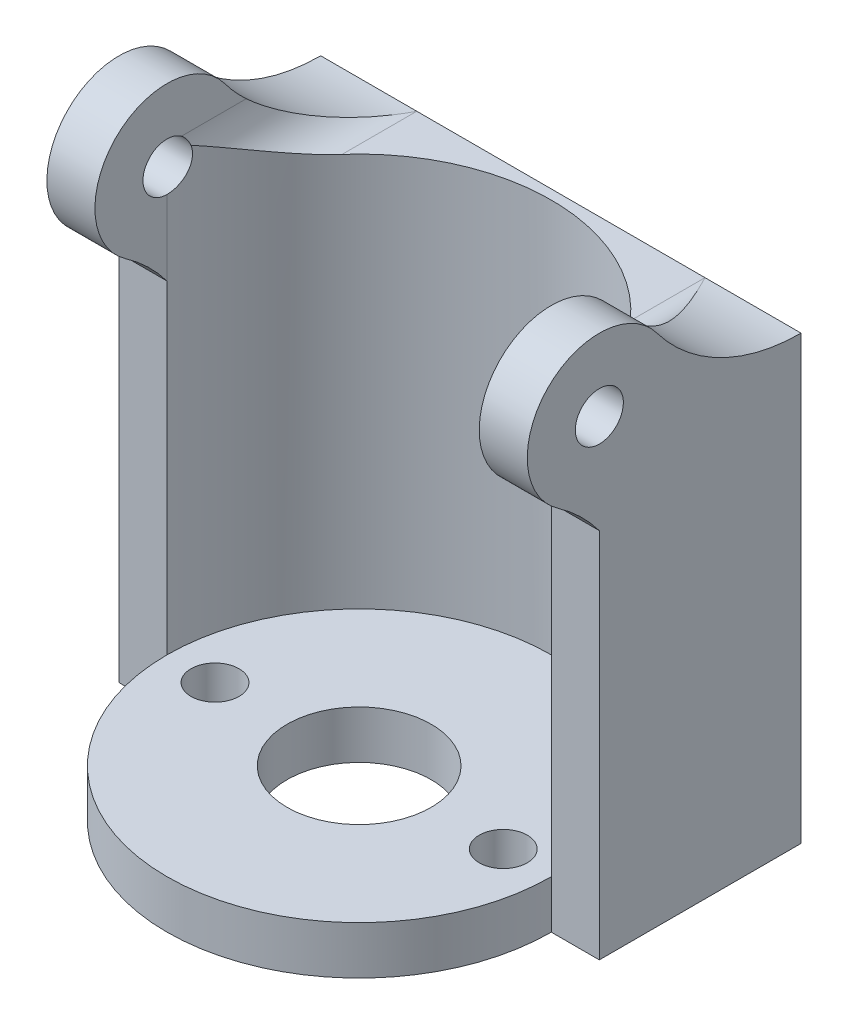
ISO-10303-21;
HEADER;
FILE_DESCRIPTION(('STEP AP214'),'2;1');
FILE_NAME('part.step','',(''),(''),'','','');
FILE_SCHEMA(('AUTOMOTIVE_DESIGN { 1 0 10303 214 1 1 1 1 }'));
ENDSEC;
DATA;
#1=APPLICATION_CONTEXT('core data for automotive mechanical design processes');
#2=APPLICATION_PROTOCOL_DEFINITION('international standard','automotive_design',2000,#1);
#3=PRODUCT_CONTEXT('',#1,'mechanical');
#4=PRODUCT('Part','Part','',(#3));
#5=PRODUCT_RELATED_PRODUCT_CATEGORY('part','',(#4));
#6=PRODUCT_DEFINITION_FORMATION('','',#4);
#7=PRODUCT_DEFINITION_CONTEXT('part definition',#1,'design');
#8=PRODUCT_DEFINITION('design','',#6,#7);
#9=PRODUCT_DEFINITION_SHAPE('','',#8);
#10=(LENGTH_UNIT() NAMED_UNIT(*) SI_UNIT(.MILLI.,.METRE.));
#11=(NAMED_UNIT(*) PLANE_ANGLE_UNIT() SI_UNIT($,.RADIAN.));
#12=(NAMED_UNIT(*) SI_UNIT($,.STERADIAN.) SOLID_ANGLE_UNIT());
#13=UNCERTAINTY_MEASURE_WITH_UNIT(LENGTH_MEASURE(1.E-05),#10,'distance_accuracy_value','');
#14=(GEOMETRIC_REPRESENTATION_CONTEXT(3) GLOBAL_UNCERTAINTY_ASSIGNED_CONTEXT((#13)) GLOBAL_UNIT_ASSIGNED_CONTEXT((#10,
#11,#12)) REPRESENTATION_CONTEXT('',''));
#15=CARTESIAN_POINT('',(0.,0.,0.));
#16=DIRECTION('',(0.,0.,1.));
#17=DIRECTION('',(1.,0.,0.));
#18=AXIS2_PLACEMENT_3D('',#15,#16,#17);
#19=CARTESIAN_POINT('',(0.,9.2,0.));
#20=DIRECTION('',(0.,1.,0.));
#21=DIRECTION('',(0.,0.,1.));
#22=AXIS2_PLACEMENT_3D('',#19,#20,#21);
#23=PLANE('',#22);
#24=DIRECTION('',(-1.,0.,0.));
#25=VECTOR('',#24,1.);
#26=CARTESIAN_POINT('',(-5.,9.2,-4.2));
#27=LINE('',#26,#25);
#28=CARTESIAN_POINT('',(3.,9.2,-4.2));
#29=VERTEX_POINT('',#28);
#30=CARTESIAN_POINT('',(-3.,9.2,-4.2));
#31=VERTEX_POINT('',#30);
#32=EDGE_CURVE('E217',#29,#31,#27,.T.);
#33=ORIENTED_EDGE('',*,*,#32,.T.);
#34=DIRECTION('',(0.,0.,-1.));
#35=VECTOR('',#34,1.);
#36=CARTESIAN_POINT('',(-3.,9.2,0.));
#37=LINE('',#36,#35);
#38=CARTESIAN_POINT('',(-3.,9.2,-2.64575131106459));
#39=VERTEX_POINT('',#38);
#40=EDGE_CURVE('E306',#31,#39,#37,.F.);
#41=ORIENTED_EDGE('',*,*,#40,.T.);
#42=CARTESIAN_POINT('',(0.,9.2,0.));
#43=DIRECTION('',(0.,-1.,0.));
#44=DIRECTION('',(0.,0.,1.));
#45=AXIS2_PLACEMENT_3D('',#42,#43,#44);
#46=CIRCLE('',#45,4.);
#47=CARTESIAN_POINT('',(3.,9.2,-2.64575131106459));
#48=VERTEX_POINT('',#47);
#49=EDGE_CURVE('E203',#39,#48,#46,.T.);
#50=ORIENTED_EDGE('',*,*,#49,.T.);
#51=DIRECTION('',(0.,0.,-1.));
#52=VECTOR('',#51,1.);
#53=CARTESIAN_POINT('',(3.,9.2,0.));
#54=LINE('',#53,#52);
#55=EDGE_CURVE('E302',#48,#29,#54,.T.);
#56=ORIENTED_EDGE('',*,*,#55,.T.);
#57=EDGE_LOOP('',(#33,#41,#50,#56));
#58=FACE_BOUND('',#57,.T.);
#59=ADVANCED_FACE('F41',(#58),#23,.T.);
#60=CARTESIAN_POINT('',(-4.,0.,0.));
#61=DIRECTION('',(0.,0.,1.));
#62=DIRECTION('',(1.,0.,0.));
#63=AXIS2_PLACEMENT_3D('',#60,#61,#62);
#64=PLANE('',#63);
#65=DIRECTION('',(0.,1.,0.));
#66=VECTOR('',#65,1.);
#67=CARTESIAN_POINT('',(-4.,0.,0.));
#68=LINE('',#67,#66);
#69=CARTESIAN_POINT('',(-4.,1.,0.));
#70=VERTEX_POINT('',#69);
#71=CARTESIAN_POINT('',(-4.,7.73938867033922,0.));
#72=VERTEX_POINT('',#71);
#73=EDGE_CURVE('E245',#70,#72,#68,.T.);
#74=ORIENTED_EDGE('',*,*,#73,.T.);
#75=DIRECTION('',(-1.,0.,0.));
#76=VECTOR('',#75,1.);
#77=CARTESIAN_POINT('',(-4.,7.73938867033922,0.));
#78=LINE('',#77,#76);
#79=CARTESIAN_POINT('',(-5.,7.73938867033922,0.));
#80=VERTEX_POINT('',#79);
#81=EDGE_CURVE('E199',#72,#80,#78,.T.);
#82=ORIENTED_EDGE('',*,*,#81,.T.);
#83=DIRECTION('',(0.,1.,0.));
#84=VECTOR('',#83,1.);
#85=CARTESIAN_POINT('',(-5.,0.,0.));
#86=LINE('',#85,#84);
#87=CARTESIAN_POINT('',(-5.,0.,0.));
#88=VERTEX_POINT('',#87);
#89=EDGE_CURVE('E246',#88,#80,#86,.T.);
#90=ORIENTED_EDGE('',*,*,#89,.F.);
#91=DIRECTION('',(1.,0.,0.));
#92=VECTOR('',#91,1.);
#93=CARTESIAN_POINT('',(-4.,0.,0.));
#94=LINE('',#93,#92);
#95=CARTESIAN_POINT('',(-4.,0.,0.));
#96=VERTEX_POINT('',#95);
#97=EDGE_CURVE('E236',#88,#96,#94,.T.);
#98=ORIENTED_EDGE('',*,*,#97,.T.);
#99=EDGE_CURVE('E240',#96,#70,#68,.T.);
#100=ORIENTED_EDGE('',*,*,#99,.T.);
#101=EDGE_LOOP('',(#74,#82,#90,#98,#100));
#102=FACE_BOUND('',#101,.T.);
#103=ADVANCED_FACE('F398',(#102),#64,.T.);
#104=CARTESIAN_POINT('',(0.,1.,0.));
#105=DIRECTION('',(0.,1.,0.));
#106=DIRECTION('',(0.,0.,1.));
#107=AXIS2_PLACEMENT_3D('',#104,#105,#106);
#108=PLANE('',#107);
#109=CARTESIAN_POINT('',(3.,1.,0.));
#110=DIRECTION('',(0.,1.,0.));
#111=DIRECTION('',(0.,0.,1.));
#112=AXIS2_PLACEMENT_3D('',#109,#110,#111);
#113=CIRCLE('',#112,0.5);
#114=CARTESIAN_POINT('',(3.,1.,0.499999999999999));
#115=VERTEX_POINT('',#114);
#116=EDGE_CURVE('E274',#115,#115,#113,.T.);
#117=ORIENTED_EDGE('',*,*,#116,.F.);
#118=EDGE_LOOP('',(#117));
#119=FACE_BOUND('',#118,.T.);
#120=CARTESIAN_POINT('',(0.,1.,0.));
#121=DIRECTION('',(0.,1.,0.));
#122=DIRECTION('',(0.,0.,1.));
#123=AXIS2_PLACEMENT_3D('',#120,#121,#122);
#124=CIRCLE('',#123,4.);
#125=CARTESIAN_POINT('',(4.,1.,0.));
#126=VERTEX_POINT('',#125);
#127=EDGE_CURVE('E290',#126,#70,#124,.T.);
#128=ORIENTED_EDGE('',*,*,#127,.T.);
#129=EDGE_CURVE('E295',#70,#126,#124,.T.);
#130=ORIENTED_EDGE('',*,*,#129,.T.);
#131=EDGE_LOOP('',(#128,#130));
#132=FACE_BOUND('',#131,.T.);
#133=CARTESIAN_POINT('',(-3.,1.,0.));
#134=DIRECTION('',(0.,1.,0.));
#135=DIRECTION('',(0.,0.,1.));
#136=AXIS2_PLACEMENT_3D('',#133,#134,#135);
#137=CIRCLE('',#136,0.5);
#138=CARTESIAN_POINT('',(-3.,1.,0.5));
#139=VERTEX_POINT('',#138);
#140=EDGE_CURVE('E282',#139,#139,#137,.T.);
#141=ORIENTED_EDGE('',*,*,#140,.F.);
#142=EDGE_LOOP('',(#141));
#143=FACE_BOUND('',#142,.T.);
#144=CARTESIAN_POINT('',(0.,1.,0.));
#145=DIRECTION('',(0.,1.,0.));
#146=DIRECTION('',(0.,0.,1.));
#147=AXIS2_PLACEMENT_3D('',#144,#145,#146);
#148=CIRCLE('',#147,1.5);
#149=CARTESIAN_POINT('',(0.,1.,1.5));
#150=VERTEX_POINT('',#149);
#151=EDGE_CURVE('E266',#150,#150,#148,.T.);
#152=ORIENTED_EDGE('',*,*,#151,.F.);
#153=EDGE_LOOP('',(#152));
#154=FACE_BOUND('',#153,.T.);
#155=ADVANCED_FACE('F405',(#119,#132,#143,#154),#108,.T.);
#156=CARTESIAN_POINT('',(0.,0.,0.));
#157=DIRECTION('',(0.,1.,0.));
#158=DIRECTION('',(0.,0.,1.));
#159=AXIS2_PLACEMENT_3D('',#156,#157,#158);
#160=PLANE('',#159);
#161=CARTESIAN_POINT('',(0.,0.,0.));
#162=DIRECTION('',(0.,1.,0.));
#163=DIRECTION('',(0.,0.,1.));
#164=AXIS2_PLACEMENT_3D('',#161,#162,#163);
#165=CIRCLE('',#164,4.);
#166=CARTESIAN_POINT('',(4.,0.,0.));
#167=VERTEX_POINT('',#166);
#168=EDGE_CURVE('E286',#96,#167,#165,.T.);
#169=ORIENTED_EDGE('',*,*,#168,.F.);
#170=ORIENTED_EDGE('',*,*,#97,.F.);
#171=DIRECTION('',(0.,0.,1.));
#172=VECTOR('',#171,1.);
#173=CARTESIAN_POINT('',(-5.,0.,0.));
#174=LINE('',#173,#172);
#175=CARTESIAN_POINT('',(-5.,0.,-4.2));
#176=VERTEX_POINT('',#175);
#177=EDGE_CURVE('E232',#176,#88,#174,.T.);
#178=ORIENTED_EDGE('',*,*,#177,.F.);
#179=DIRECTION('',(-1.,0.,0.));
#180=VECTOR('',#179,1.);
#181=CARTESIAN_POINT('',(-5.,0.,-4.2));
#182=LINE('',#181,#180);
#183=CARTESIAN_POINT('',(5.,0.,-4.2));
#184=VERTEX_POINT('',#183);
#185=EDGE_CURVE('E228',#184,#176,#182,.T.);
#186=ORIENTED_EDGE('',*,*,#185,.F.);
#187=DIRECTION('',(0.,0.,-1.));
#188=VECTOR('',#187,1.);
#189=CARTESIAN_POINT('',(5.,0.,-4.2));
#190=LINE('',#189,#188);
#191=CARTESIAN_POINT('',(5.,0.,0.));
#192=VERTEX_POINT('',#191);
#193=EDGE_CURVE('E224',#192,#184,#190,.T.);
#194=ORIENTED_EDGE('',*,*,#193,.F.);
#195=DIRECTION('',(1.,0.,0.));
#196=VECTOR('',#195,1.);
#197=CARTESIAN_POINT('',(5.,0.,0.));
#198=LINE('',#197,#196);
#199=EDGE_CURVE('E220',#167,#192,#198,.T.);
#200=ORIENTED_EDGE('',*,*,#199,.F.);
#201=EDGE_LOOP('',(#169,#170,#178,#186,#194,#200));
#202=FACE_BOUND('',#201,.T.);
#203=CARTESIAN_POINT('',(-3.,0.,0.));
#204=DIRECTION('',(0.,1.,0.));
#205=DIRECTION('',(0.,0.,1.));
#206=AXIS2_PLACEMENT_3D('',#203,#204,#205);
#207=CIRCLE('',#206,0.5);
#208=CARTESIAN_POINT('',(-3.,0.,0.5));
#209=VERTEX_POINT('',#208);
#210=EDGE_CURVE('E278',#209,#209,#207,.T.);
#211=ORIENTED_EDGE('',*,*,#210,.T.);
#212=EDGE_LOOP('',(#211));
#213=FACE_BOUND('',#212,.T.);
#214=CARTESIAN_POINT('',(3.,0.,0.));
#215=DIRECTION('',(0.,1.,0.));
#216=DIRECTION('',(0.,0.,1.));
#217=AXIS2_PLACEMENT_3D('',#214,#215,#216);
#218=CIRCLE('',#217,0.5);
#219=CARTESIAN_POINT('',(3.,0.,0.499999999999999));
#220=VERTEX_POINT('',#219);
#221=EDGE_CURVE('E270',#220,#220,#218,.T.);
#222=ORIENTED_EDGE('',*,*,#221,.T.);
#223=EDGE_LOOP('',(#222));
#224=FACE_BOUND('',#223,.T.);
#225=CARTESIAN_POINT('',(0.,0.,0.));
#226=DIRECTION('',(0.,1.,0.));
#227=DIRECTION('',(0.,0.,1.));
#228=AXIS2_PLACEMENT_3D('',#225,#226,#227);
#229=CIRCLE('',#228,1.5);
#230=CARTESIAN_POINT('',(0.,0.,1.5));
#231=VERTEX_POINT('',#230);
#232=EDGE_CURVE('E244',#231,#231,#229,.T.);
#233=ORIENTED_EDGE('',*,*,#232,.T.);
#234=EDGE_LOOP('',(#233));
#235=FACE_BOUND('',#234,.T.);
#236=ADVANCED_FACE('F542',(#202,#213,#224,#235),#160,.F.);
#237=CARTESIAN_POINT('',(0.,1.,0.));
#238=DIRECTION('',(0.,-1.,0.));
#239=DIRECTION('',(0.,0.,-1.));
#240=AXIS2_PLACEMENT_3D('',#237,#238,#239);
#241=CYLINDRICAL_SURFACE('',#240,4.);
#242=ORIENTED_EDGE('',*,*,#129,.F.);
#243=ORIENTED_EDGE('',*,*,#99,.F.);
#244=ORIENTED_EDGE('',*,*,#168,.T.);
#245=DIRECTION('',(0.,1.,0.));
#246=VECTOR('',#245,1.);
#247=CARTESIAN_POINT('',(4.,0.,0.));
#248=LINE('',#247,#246);
#249=EDGE_CURVE('E262',#167,#126,#248,.T.);
#250=ORIENTED_EDGE('',*,*,#249,.T.);
#251=EDGE_LOOP('',(#242,#243,#244,#250));
#252=FACE_BOUND('',#251,.T.);
#253=ADVANCED_FACE('F539',(#252),#241,.T.);
#254=CARTESIAN_POINT('',(-3.,1.,0.));
#255=DIRECTION('',(0.,-1.,0.));
#256=DIRECTION('',(0.,0.,-1.));
#257=AXIS2_PLACEMENT_3D('',#254,#255,#256);
#258=CYLINDRICAL_SURFACE('',#257,0.5);
#259=ORIENTED_EDGE('',*,*,#140,.T.);
#260=EDGE_LOOP('',(#259));
#261=FACE_BOUND('',#260,.T.);
#262=ORIENTED_EDGE('',*,*,#210,.F.);
#263=EDGE_LOOP('',(#262));
#264=FACE_BOUND('',#263,.T.);
#265=ADVANCED_FACE('F667',(#261,#264),#258,.F.);
#266=CARTESIAN_POINT('',(3.,1.,0.));
#267=DIRECTION('',(0.,-1.,0.));
#268=DIRECTION('',(0.,0.,-1.));
#269=AXIS2_PLACEMENT_3D('',#266,#267,#268);
#270=CYLINDRICAL_SURFACE('',#269,0.5);
#271=ORIENTED_EDGE('',*,*,#116,.T.);
#272=EDGE_LOOP('',(#271));
#273=FACE_BOUND('',#272,.T.);
#274=ORIENTED_EDGE('',*,*,#221,.F.);
#275=EDGE_LOOP('',(#274));
#276=FACE_BOUND('',#275,.T.);
#277=ADVANCED_FACE('F688',(#273,#276),#270,.F.);
#278=CARTESIAN_POINT('',(0.,1.,0.));
#279=DIRECTION('',(0.,-1.,0.));
#280=DIRECTION('',(0.,0.,-1.));
#281=AXIS2_PLACEMENT_3D('',#278,#279,#280);
#282=CYLINDRICAL_SURFACE('',#281,1.5);
#283=ORIENTED_EDGE('',*,*,#151,.T.);
#284=EDGE_LOOP('',(#283));
#285=FACE_BOUND('',#284,.T.);
#286=ORIENTED_EDGE('',*,*,#232,.F.);
#287=EDGE_LOOP('',(#286));
#288=FACE_BOUND('',#287,.T.);
#289=ADVANCED_FACE('F358',(#285,#288),#282,.F.);
#290=CARTESIAN_POINT('',(0.,0.,0.));
#291=DIRECTION('',(0.,1.,0.));
#292=DIRECTION('',(0.,0.,1.));
#293=AXIS2_PLACEMENT_3D('',#290,#291,#292);
#294=CYLINDRICAL_SURFACE('',#293,4.);
#295=ORIENTED_EDGE('',*,*,#73,.F.);
#296=ORIENTED_EDGE('',*,*,#127,.F.);
#297=CARTESIAN_POINT('',(4.,7.73938867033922,0.));
#298=VERTEX_POINT('',#297);
#299=EDGE_CURVE('E116',#126,#298,#248,.T.);
#300=ORIENTED_EDGE('',*,*,#299,.T.);
#301=DIRECTION('',(0.,1.,0.));
#302=VECTOR('',#301,1.);
#303=CARTESIAN_POINT('',(4.,0.,0.));
#304=LINE('',#303,#302);
#305=CARTESIAN_POINT('',(4.,9.3,0.));
#306=VERTEX_POINT('',#305);
#307=EDGE_CURVE('E110',#298,#306,#304,.T.);
#308=ORIENTED_EDGE('',*,*,#307,.T.);
#309=CARTESIAN_POINT('',(3.97206801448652,9.96530067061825,-0.471885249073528));
#310=CARTESIAN_POINT('',(3.97096019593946,9.9389579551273,-0.481139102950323));
#311=CARTESIAN_POINT('',(3.97010345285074,9.91182189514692,-0.488142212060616));
#312=CARTESIAN_POINT('',(3.96894084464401,9.85677347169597,-0.497543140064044));
#313=CARTESIAN_POINT('',(3.96863454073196,9.82886174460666,-0.499944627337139));
#314=CARTESIAN_POINT('',(3.96861961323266,9.77301230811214,-0.500053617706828));
#315=CARTESIAN_POINT('',(3.96891132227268,9.74507459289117,-0.497758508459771));
#316=CARTESIAN_POINT('',(3.9700560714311,9.68999130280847,-0.488546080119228));
#317=CARTESIAN_POINT('',(3.97090899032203,9.66284555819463,-0.481629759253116));
#318=CARTESIAN_POINT('',(3.97308013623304,9.61010208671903,-0.46337646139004));
#319=CARTESIAN_POINT('',(3.97439839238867,9.58450445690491,-0.45203920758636));
#320=CARTESIAN_POINT('',(3.97735199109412,9.5355641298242,-0.425266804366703));
#321=CARTESIAN_POINT('',(3.97898740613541,9.5122219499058,-0.409830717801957));
#322=CARTESIAN_POINT('',(3.98240454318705,9.468292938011,-0.375177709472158));
#323=CARTESIAN_POINT('',(3.98418717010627,9.44772556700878,-0.355936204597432));
#324=CARTESIAN_POINT('',(3.98768944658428,9.41010410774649,-0.314275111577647));
#325=CARTESIAN_POINT('',(3.98940909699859,9.39304997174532,-0.291855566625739));
#326=CARTESIAN_POINT('',(3.99259910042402,9.36287960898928,-0.244376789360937));
#327=CARTESIAN_POINT('',(3.99406851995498,9.34977799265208,-0.219308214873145));
#328=CARTESIAN_POINT('',(3.99658401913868,9.32798125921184,-0.167307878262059));
#329=CARTESIAN_POINT('',(3.997630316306,9.31928387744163,-0.140377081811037));
#330=CARTESIAN_POINT('',(3.99892857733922,9.30862645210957,-0.0944113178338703));
#331=CARTESIAN_POINT('',(3.99932831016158,9.30539423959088,-0.0756654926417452));
#332=CARTESIAN_POINT('',(3.99986488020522,9.30108087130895,-0.0379491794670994));
#333=CARTESIAN_POINT('',(4.00000205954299,9.29999691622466,-0.0189790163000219));
#334=CARTESIAN_POINT('',(4.,9.3,0.));
#335=B_SPLINE_CURVE_WITH_KNOTS('',3,(#309,#310,#311,#312,#313,#314,#315,#316,#317,#318,#319,
#320,#321,#322,#323,#324,#325,#326,#327,#328,#329,#330,#331,#332,#333,#334),.UNSPECIFIED.,.F.,
.F.,(4,2,2,2,2,2,2,2,2,2,2,2,4),(0.,0.0837199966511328,0.167373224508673,0.251072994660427,
0.33475469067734,0.418441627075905,0.502147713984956,0.586413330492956,0.670677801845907,
0.755250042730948,0.839778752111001,0.896741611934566,0.953630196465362),.UNSPECIFIED.);
#336=CARTESIAN_POINT('',(3.97206801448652,9.96530067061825,-0.471885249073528));
#337=VERTEX_POINT('',#336);
#338=EDGE_CURVE('E11',#306,#337,#335,.F.);
#339=ORIENTED_EDGE('',*,*,#338,.T.);
#340=CARTESIAN_POINT('',(3.,9.2,-2.64575131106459));
#341=CARTESIAN_POINT('',(3.04308129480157,9.20002225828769,-2.5969164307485));
#342=CARTESIAN_POINT('',(3.08491225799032,9.20278131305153,-2.54706628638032));
#343=CARTESIAN_POINT('',(3.16580783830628,9.21299606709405,-2.44577843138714));
#344=CARTESIAN_POINT('',(3.20487760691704,9.22044274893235,-2.39434394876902));
#345=CARTESIAN_POINT('',(3.27984708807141,9.23918561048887,-2.29056221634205));
#346=CARTESIAN_POINT('',(3.31576990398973,9.25045013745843,-2.2382257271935));
#347=CARTESIAN_POINT('',(3.38476417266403,9.27625009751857,-2.13245420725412));
#348=CARTESIAN_POINT('',(3.41783373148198,9.29078768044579,-2.0790184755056));
#349=CARTESIAN_POINT('',(3.4986969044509,9.33147169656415,-1.94128133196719));
#350=CARTESIAN_POINT('',(3.54444475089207,9.3595766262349,-1.85634962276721));
#351=CARTESIAN_POINT('',(3.62906229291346,9.4208922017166,-1.68494910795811));
#352=CARTESIAN_POINT('',(3.66792956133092,9.45410464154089,-1.59847977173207));
#353=CARTESIAN_POINT('',(3.77483346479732,9.55989549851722,-1.33652816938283));
#354=CARTESIAN_POINT('',(3.83275455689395,9.63839391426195,-1.159225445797));
#355=CARTESIAN_POINT('',(3.91850936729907,9.79560237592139,-0.820227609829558));
#356=CARTESIAN_POINT('',(3.94876568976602,9.87351220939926,-0.658737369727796));
#357=CARTESIAN_POINT('',(3.98924683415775,10.0324153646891,-0.335223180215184));
#358=CARTESIAN_POINT('',(3.99952627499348,10.1133996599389,-0.173201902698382));
#359=CARTESIAN_POINT('',(3.99999466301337,10.1962288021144,-0.00754240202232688));
#360=CARTESIAN_POINT('',(3.99999999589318,10.1981144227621,-0.0037711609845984));
#361=CARTESIAN_POINT('',(4.,10.2,0.));
#362=B_SPLINE_CURVE_WITH_KNOTS('',3,(#340,#341,#342,#343,#344,#345,#346,#347,#348,#349,#350,
#351,#352,#353,#354,#355,#356,#357,#358,#359,#360,#361),.UNSPECIFIED.,.F.,.F.,(4,2,2,2,2,2,2,2,
2,2,4),(0.,0.195194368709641,0.390014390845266,0.583257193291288,0.776627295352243,
1.07759313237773,1.37866492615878,1.98338003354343,2.52784959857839,3.07082842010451,
3.08347754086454),.UNSPECIFIED.);
#363=EDGE_CURVE('E95',#337,#48,#362,.F.);
#364=ORIENTED_EDGE('',*,*,#363,.T.);
#365=ORIENTED_EDGE('',*,*,#49,.F.);
#366=CARTESIAN_POINT('',(-3.,9.2,-2.64575131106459));
#367=CARTESIAN_POINT('',(-3.04308129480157,9.20002225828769,-2.5969164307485));
#368=CARTESIAN_POINT('',(-3.08491225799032,9.20278131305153,-2.54706628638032));
#369=CARTESIAN_POINT('',(-3.16580783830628,9.21299606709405,-2.44577843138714));
#370=CARTESIAN_POINT('',(-3.20487760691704,9.22044274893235,-2.39434394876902));
#371=CARTESIAN_POINT('',(-3.27984708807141,9.23918561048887,-2.29056221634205));
#372=CARTESIAN_POINT('',(-3.31576990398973,9.25045013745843,-2.2382257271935));
#373=CARTESIAN_POINT('',(-3.38476417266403,9.27625009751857,-2.13245420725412));
#374=CARTESIAN_POINT('',(-3.41783373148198,9.29078768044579,-2.0790184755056));
#375=CARTESIAN_POINT('',(-3.4986969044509,9.33147169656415,-1.94128133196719));
#376=CARTESIAN_POINT('',(-3.54444475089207,9.3595766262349,-1.85634962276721));
#377=CARTESIAN_POINT('',(-3.62906229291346,9.4208922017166,-1.68494910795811));
#378=CARTESIAN_POINT('',(-3.66792956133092,9.45410464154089,-1.59847977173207));
#379=CARTESIAN_POINT('',(-3.77483346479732,9.55989549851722,-1.33652816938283));
#380=CARTESIAN_POINT('',(-3.83275455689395,9.63839391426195,-1.159225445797));
#381=CARTESIAN_POINT('',(-3.91850936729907,9.79560237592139,-0.820227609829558));
#382=CARTESIAN_POINT('',(-3.94876568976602,9.87351220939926,-0.658737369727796));
#383=CARTESIAN_POINT('',(-3.98924683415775,10.0324153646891,-0.335223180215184));
#384=CARTESIAN_POINT('',(-3.99952627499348,10.1133996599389,-0.173201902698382));
#385=CARTESIAN_POINT('',(-3.99999466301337,10.1962288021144,-0.00754240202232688));
#386=CARTESIAN_POINT('',(-3.99999999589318,10.1981144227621,-0.0037711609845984));
#387=CARTESIAN_POINT('',(-4.,10.2,0.));
#388=B_SPLINE_CURVE_WITH_KNOTS('',3,(#366,#367,#368,#369,#370,#371,#372,#373,#374,#375,#376,
#377,#378,#379,#380,#381,#382,#383,#384,#385,#386,#387),.UNSPECIFIED.,.F.,.F.,(4,2,2,2,2,2,2,2,
2,2,4),(0.,0.195194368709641,0.390014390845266,0.583257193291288,0.776627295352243,
1.07759313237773,1.37866492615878,1.98338003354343,2.52784959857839,3.07082842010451,
3.08347754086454),.UNSPECIFIED.);
#389=CARTESIAN_POINT('',(-3.97206801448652,9.96530067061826,-0.471885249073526));
#390=VERTEX_POINT('',#389);
#391=EDGE_CURVE('E72',#39,#390,#388,.T.);
#392=ORIENTED_EDGE('',*,*,#391,.T.);
#393=CARTESIAN_POINT('',(-4.,9.3,0.));
#394=CARTESIAN_POINT('',(-4.00001123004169,9.29997559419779,-0.0280129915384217));
#395=CARTESIAN_POINT('',(-3.99970605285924,9.30235266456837,-0.0560164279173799));
#396=CARTESIAN_POINT('',(-3.9985461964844,9.31172695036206,-0.111199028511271));
#397=CARTESIAN_POINT('',(-3.99769208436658,9.31871939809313,-0.13837901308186));
#398=CARTESIAN_POINT('',(-3.99551699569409,9.33714533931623,-0.191179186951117));
#399=CARTESIAN_POINT('',(-3.99419586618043,9.34858028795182,-0.216798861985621));
#400=CARTESIAN_POINT('',(-3.99123730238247,9.3755527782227,-0.265753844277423));
#401=CARTESIAN_POINT('',(-3.98959989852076,9.3910899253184,-0.289089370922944));
#402=CARTESIAN_POINT('',(-3.98618081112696,9.42591714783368,-0.33294125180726));
#403=CARTESIAN_POINT('',(-3.98439847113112,9.44522492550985,-0.353443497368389));
#404=CARTESIAN_POINT('',(-3.98089565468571,9.48700976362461,-0.390928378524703));
#405=CARTESIAN_POINT('',(-3.97917518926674,9.50948738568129,-0.407910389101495));
#406=CARTESIAN_POINT('',(-3.97598457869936,9.55706445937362,-0.437922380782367));
#407=CARTESIAN_POINT('',(-3.97451528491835,9.58217238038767,-0.45093903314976));
#408=CARTESIAN_POINT('',(-3.97200221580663,9.6342387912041,-0.472564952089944));
#409=CARTESIAN_POINT('',(-3.97095840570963,9.66119712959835,-0.481174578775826));
#410=CARTESIAN_POINT('',(-3.96942049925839,9.71605374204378,-0.493701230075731));
#411=CARTESIAN_POINT('',(-3.96892367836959,9.74394663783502,-0.497641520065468));
#412=CARTESIAN_POINT('',(-3.96852818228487,9.79999960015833,-0.500786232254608));
#413=CARTESIAN_POINT('',(-3.9686292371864,9.82815954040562,-0.499992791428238));
#414=CARTESIAN_POINT('',(-3.96928530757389,9.87465876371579,-0.49475054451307));
#415=CARTESIAN_POINT('',(-3.96967862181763,9.89315719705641,-0.49160155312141));
#416=CARTESIAN_POINT('',(-3.97070197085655,9.92965197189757,-0.483260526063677));
#417=CARTESIAN_POINT('',(-3.97133165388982,9.9476490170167,-0.47807152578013));
#418=CARTESIAN_POINT('',(-3.97206801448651,9.96530067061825,-0.471885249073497));
#419=B_SPLINE_CURVE_WITH_KNOTS('',3,(#393,#394,#395,#396,#397,#398,#399,#400,#401,#402,#403,
#404,#405,#406,#407,#408,#409,#410,#411,#412,#413,#414,#415,#416,#417,#418),.UNSPECIFIED.,.F.,
.F.,(4,2,2,2,2,2,2,2,2,2,2,2,4),(0.,0.0839225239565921,0.167758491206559,0.25162194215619,
0.33547733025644,0.419736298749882,0.504010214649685,0.588564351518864,0.673111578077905,
0.757235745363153,0.841321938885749,0.89751610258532,0.953626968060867),.UNSPECIFIED.);
#420=CARTESIAN_POINT('',(-4.,9.3,0.));
#421=VERTEX_POINT('',#420);
#422=EDGE_CURVE('E57',#421,#390,#419,.T.);
#423=ORIENTED_EDGE('',*,*,#422,.F.);
#424=DIRECTION('',(0.,1.,0.));
#425=VECTOR('',#424,1.);
#426=CARTESIAN_POINT('',(-4.,0.,0.));
#427=LINE('',#426,#425);
#428=EDGE_CURVE('E176',#72,#421,#427,.T.);
#429=ORIENTED_EDGE('',*,*,#428,.F.);
#430=EDGE_LOOP('',(#295,#296,#300,#308,#339,#364,#365,#392,#423,#429));
#431=FACE_BOUND('',#430,.T.);
#432=ADVANCED_FACE('F112',(#431),#294,.F.);
#433=CARTESIAN_POINT('',(-5.,0.,0.));
#434=DIRECTION('',(-1.,0.,0.));
#435=DIRECTION('',(0.,0.,1.));
#436=AXIS2_PLACEMENT_3D('',#433,#434,#435);
#437=PLANE('',#436);
#438=ORIENTED_EDGE('',*,*,#89,.T.);
#439=CARTESIAN_POINT('',(-5.,5.49396741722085,3.00342860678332));
#440=DIRECTION('',(-1.,0.,0.));
#441=DIRECTION('',(0.,0.,1.));
#442=AXIS2_PLACEMENT_3D('',#439,#440,#441);
#443=CIRCLE('',#442,3.75);
#444=CARTESIAN_POINT('',(-5.,8.56970497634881,0.858122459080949));
#445=VERTEX_POINT('',#444);
#446=EDGE_CURVE('E159',#445,#80,#443,.T.);
#447=ORIENTED_EDGE('',*,*,#446,.F.);
#448=CARTESIAN_POINT('',(-5.,9.8,0.));
#449=DIRECTION('',(-1.,0.,0.));
#450=DIRECTION('',(0.,0.,1.));
#451=AXIS2_PLACEMENT_3D('',#448,#449,#450);
#452=CIRCLE('',#451,1.5);
#453=CARTESIAN_POINT('',(-5.,10.7,-1.2));
#454=VERTEX_POINT('',#453);
#455=EDGE_CURVE('E188',#445,#454,#452,.T.);
#456=ORIENTED_EDGE('',*,*,#455,.T.);
#457=CARTESIAN_POINT('',(-5.,12.95,-4.2));
#458=DIRECTION('',(-1.,0.,0.));
#459=DIRECTION('',(0.,0.,1.));
#460=AXIS2_PLACEMENT_3D('',#457,#458,#459);
#461=CIRCLE('',#460,3.75);
#462=CARTESIAN_POINT('',(-5.,9.2,-4.2));
#463=VERTEX_POINT('',#462);
#464=EDGE_CURVE('E192',#454,#463,#461,.F.);
#465=ORIENTED_EDGE('',*,*,#464,.T.);
#466=DIRECTION('',(0.,1.,0.));
#467=VECTOR('',#466,1.);
#468=CARTESIAN_POINT('',(-5.,0.,-4.2));
#469=LINE('',#468,#467);
#470=EDGE_CURVE('E250',#176,#463,#469,.T.);
#471=ORIENTED_EDGE('',*,*,#470,.F.);
#472=ORIENTED_EDGE('',*,*,#177,.T.);
#473=EDGE_LOOP('',(#438,#447,#456,#465,#471,#472));
#474=FACE_BOUND('',#473,.T.);
#475=CARTESIAN_POINT('',(-5.,9.8,0.));
#476=DIRECTION('',(-1.,0.,0.));
#477=DIRECTION('',(0.,0.,1.));
#478=AXIS2_PLACEMENT_3D('',#475,#476,#477);
#479=CIRCLE('',#478,0.5);
#480=CARTESIAN_POINT('',(-5.,9.8,0.5));
#481=VERTEX_POINT('',#480);
#482=EDGE_CURVE('E168',#481,#481,#479,.T.);
#483=ORIENTED_EDGE('',*,*,#482,.F.);
#484=EDGE_LOOP('',(#483));
#485=FACE_BOUND('',#484,.T.);
#486=ADVANCED_FACE('F357',(#474,#485),#437,.T.);
#487=CARTESIAN_POINT('',(-5.,0.,-4.2));
#488=DIRECTION('',(0.,0.,-1.));
#489=DIRECTION('',(-1.,0.,0.));
#490=AXIS2_PLACEMENT_3D('',#487,#488,#489);
#491=PLANE('',#490);
#492=ORIENTED_EDGE('',*,*,#470,.T.);
#493=DIRECTION('',(-1.,0.,0.));
#494=VECTOR('',#493,1.);
#495=CARTESIAN_POINT('',(-4.,9.2,-4.2));
#496=LINE('',#495,#494);
#497=EDGE_CURVE('E204',#31,#463,#496,.T.);
#498=ORIENTED_EDGE('',*,*,#497,.F.);
#499=ORIENTED_EDGE('',*,*,#32,.F.);
#500=CARTESIAN_POINT('',(5.,9.2,-4.2));
#501=VERTEX_POINT('',#500);
#502=EDGE_CURVE('E87',#501,#29,#27,.T.);
#503=ORIENTED_EDGE('',*,*,#502,.F.);
#504=DIRECTION('',(0.,1.,0.));
#505=VECTOR('',#504,1.);
#506=CARTESIAN_POINT('',(5.,0.,-4.2));
#507=LINE('',#506,#505);
#508=EDGE_CURVE('E254',#184,#501,#507,.T.);
#509=ORIENTED_EDGE('',*,*,#508,.F.);
#510=ORIENTED_EDGE('',*,*,#185,.T.);
#511=EDGE_LOOP('',(#492,#498,#499,#503,#509,#510));
#512=FACE_BOUND('',#511,.T.);
#513=ADVANCED_FACE('F414',(#512),#491,.T.);
#514=CARTESIAN_POINT('',(5.,0.,-4.2));
#515=DIRECTION('',(1.,0.,0.));
#516=DIRECTION('',(0.,0.,-1.));
#517=AXIS2_PLACEMENT_3D('',#514,#515,#516);
#518=PLANE('',#517);
#519=ORIENTED_EDGE('',*,*,#508,.T.);
#520=CARTESIAN_POINT('',(5.,12.95,-4.2));
#521=DIRECTION('',(-1.,0.,0.));
#522=DIRECTION('',(0.,0.,1.));
#523=AXIS2_PLACEMENT_3D('',#520,#521,#522);
#524=CIRCLE('',#523,3.75);
#525=CARTESIAN_POINT('',(5.,10.7,-1.2));
#526=VERTEX_POINT('',#525);
#527=EDGE_CURVE('E144',#526,#501,#524,.F.);
#528=ORIENTED_EDGE('',*,*,#527,.F.);
#529=CARTESIAN_POINT('',(5.,9.8,0.));
#530=DIRECTION('',(-1.,0.,0.));
#531=DIRECTION('',(0.,0.,1.));
#532=AXIS2_PLACEMENT_3D('',#529,#530,#531);
#533=CIRCLE('',#532,1.5);
#534=CARTESIAN_POINT('',(5.,8.56970497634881,0.858122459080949));
#535=VERTEX_POINT('',#534);
#536=EDGE_CURVE('E147',#535,#526,#533,.T.);
#537=ORIENTED_EDGE('',*,*,#536,.F.);
#538=CARTESIAN_POINT('',(5.,5.49396741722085,3.00342860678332));
#539=DIRECTION('',(-1.,0.,0.));
#540=DIRECTION('',(0.,0.,1.));
#541=AXIS2_PLACEMENT_3D('',#538,#539,#540);
#542=CIRCLE('',#541,3.75);
#543=CARTESIAN_POINT('',(5.,7.73938867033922,0.));
#544=VERTEX_POINT('',#543);
#545=EDGE_CURVE('E140',#535,#544,#542,.T.);
#546=ORIENTED_EDGE('',*,*,#545,.T.);
#547=DIRECTION('',(0.,1.,0.));
#548=VECTOR('',#547,1.);
#549=CARTESIAN_POINT('',(5.,0.,0.));
#550=LINE('',#549,#548);
#551=EDGE_CURVE('E258',#192,#544,#550,.T.);
#552=ORIENTED_EDGE('',*,*,#551,.F.);
#553=ORIENTED_EDGE('',*,*,#193,.T.);
#554=EDGE_LOOP('',(#519,#528,#537,#546,#552,#553));
#555=FACE_BOUND('',#554,.T.);
#556=CARTESIAN_POINT('',(5.,9.8,0.));
#557=DIRECTION('',(-1.,0.,0.));
#558=DIRECTION('',(0.,0.,1.));
#559=AXIS2_PLACEMENT_3D('',#556,#557,#558);
#560=CIRCLE('',#559,0.5);
#561=CARTESIAN_POINT('',(5.,9.8,0.5));
#562=VERTEX_POINT('',#561);
#563=EDGE_CURVE('E151',#562,#562,#560,.T.);
#564=ORIENTED_EDGE('',*,*,#563,.T.);
#565=EDGE_LOOP('',(#564));
#566=FACE_BOUND('',#565,.T.);
#567=ADVANCED_FACE('F417',(#555,#566),#518,.T.);
#568=CARTESIAN_POINT('',(5.,0.,0.));
#569=DIRECTION('',(0.,0.,1.));
#570=DIRECTION('',(1.,0.,0.));
#571=AXIS2_PLACEMENT_3D('',#568,#569,#570);
#572=PLANE('',#571);
#573=DIRECTION('',(1.,0.,0.));
#574=VECTOR('',#573,1.);
#575=CARTESIAN_POINT('',(4.,7.73938867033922,0.));
#576=LINE('',#575,#574);
#577=EDGE_CURVE('E128',#298,#544,#576,.T.);
#578=ORIENTED_EDGE('',*,*,#577,.F.);
#579=ORIENTED_EDGE('',*,*,#299,.F.);
#580=ORIENTED_EDGE('',*,*,#249,.F.);
#581=ORIENTED_EDGE('',*,*,#199,.T.);
#582=ORIENTED_EDGE('',*,*,#551,.T.);
#583=EDGE_LOOP('',(#578,#579,#580,#581,#582));
#584=FACE_BOUND('',#583,.T.);
#585=ADVANCED_FACE('F359',(#584),#572,.T.);
#586=CARTESIAN_POINT('',(-4.,5.49396741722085,3.00342860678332));
#587=DIRECTION('',(-1.,0.,0.));
#588=DIRECTION('',(0.,0.,1.));
#589=AXIS2_PLACEMENT_3D('',#586,#587,#588);
#590=CYLINDRICAL_SURFACE('',#589,3.75);
#591=ORIENTED_EDGE('',*,*,#446,.T.);
#592=ORIENTED_EDGE('',*,*,#81,.F.);
#593=CARTESIAN_POINT('',(-4.,5.49396741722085,3.00342860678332));
#594=DIRECTION('',(-1.,0.,0.));
#595=DIRECTION('',(0.,0.,1.));
#596=AXIS2_PLACEMENT_3D('',#593,#594,#595);
#597=CIRCLE('',#596,3.75);
#598=CARTESIAN_POINT('',(-4.,8.56970497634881,0.858122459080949));
#599=VERTEX_POINT('',#598);
#600=EDGE_CURVE('E163',#599,#72,#597,.T.);
#601=ORIENTED_EDGE('',*,*,#600,.F.);
#602=DIRECTION('',(-1.,0.,0.));
#603=VECTOR('',#602,1.);
#604=CARTESIAN_POINT('',(-4.,8.56970497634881,0.858122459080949));
#605=LINE('',#604,#603);
#606=EDGE_CURVE('E184',#599,#445,#605,.T.);
#607=ORIENTED_EDGE('',*,*,#606,.T.);
#608=EDGE_LOOP('',(#591,#592,#601,#607));
#609=FACE_BOUND('',#608,.T.);
#610=ADVANCED_FACE('F410',(#609),#590,.F.);
#611=CARTESIAN_POINT('',(-4.,12.95,-4.2));
#612=DIRECTION('',(-1.,0.,0.));
#613=DIRECTION('',(0.,0.,1.));
#614=AXIS2_PLACEMENT_3D('',#611,#612,#613);
#615=CYLINDRICAL_SURFACE('',#614,3.75);
#616=ORIENTED_EDGE('',*,*,#464,.F.);
#617=DIRECTION('',(-1.,0.,0.));
#618=VECTOR('',#617,1.);
#619=CARTESIAN_POINT('',(-4.,10.7,-1.2));
#620=LINE('',#619,#618);
#621=CARTESIAN_POINT('',(-4.,10.7,-1.2));
#622=VERTEX_POINT('',#621);
#623=EDGE_CURVE('E208',#622,#454,#620,.T.);
#624=ORIENTED_EDGE('',*,*,#623,.F.);
#625=CARTESIAN_POINT('',(-4.,12.95,-4.2));
#626=DIRECTION('',(-1.,0.,0.));
#627=DIRECTION('',(0.,0.,1.));
#628=AXIS2_PLACEMENT_3D('',#625,#626,#627);
#629=CIRCLE('',#628,3.75);
#630=CARTESIAN_POINT('',(-4.,10.2,-1.65049024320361));
#631=VERTEX_POINT('',#630);
#632=EDGE_CURVE('E172',#622,#631,#629,.F.);
#633=ORIENTED_EDGE('',*,*,#632,.T.);
#634=CARTESIAN_POINT('',(-4.,10.2,-1.65049024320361));
#635=CARTESIAN_POINT('',(-3.99998115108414,10.1580633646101,-1.69571068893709));
#636=CARTESIAN_POINT('',(-3.9973643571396,10.117297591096,-1.74193337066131));
#637=CARTESIAN_POINT('',(-3.98765544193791,10.0383739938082,-1.83596219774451));
#638=CARTESIAN_POINT('',(-3.98057191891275,10.0002113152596,-1.88376513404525));
#639=CARTESIAN_POINT('',(-3.96272055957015,9.92690976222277,-1.98029863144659));
#640=CARTESIAN_POINT('',(-3.95198446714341,9.89174799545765,-2.02901789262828));
#641=CARTESIAN_POINT('',(-3.92737043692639,9.82412837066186,-2.12756192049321));
#642=CARTESIAN_POINT('',(-3.91349043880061,9.79167230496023,-2.17738739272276));
#643=CARTESIAN_POINT('',(-3.87496367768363,9.71290916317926,-2.30475420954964));
#644=CARTESIAN_POINT('',(-3.8485231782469,9.66844914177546,-2.38290194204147));
#645=CARTESIAN_POINT('',(-3.79082164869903,9.58588575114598,-2.54072994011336));
#646=CARTESIAN_POINT('',(-3.75955902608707,9.54778449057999,-2.6204107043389));
#647=CARTESIAN_POINT('',(-3.6598870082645,9.4424083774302,-2.86199173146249));
#648=CARTESIAN_POINT('',(-3.58582902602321,9.38449604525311,-3.02571598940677));
#649=CARTESIAN_POINT('',(-3.42925896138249,9.29225226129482,-3.35571145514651));
#650=CARTESIAN_POINT('',(-3.34673570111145,9.25795246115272,-3.5219857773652));
#651=CARTESIAN_POINT('',(-3.17798913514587,9.21210868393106,-3.85526836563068));
#652=CARTESIAN_POINT('',(-3.09177712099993,9.20049971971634,-4.02227315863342));
#653=CARTESIAN_POINT('',(-3.00374630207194,9.20000526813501,-4.19274531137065));
#654=CARTESIAN_POINT('',(-3.0018731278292,9.20000000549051,-4.19637269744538));
#655=CARTESIAN_POINT('',(-3.,9.2,-4.2));
#656=B_SPLINE_CURVE_WITH_KNOTS('',3,(#634,#635,#636,#637,#638,#639,#640,#641,#642,#643,#644,
#645,#646,#647,#648,#649,#650,#651,#652,#653,#654,#655),.UNSPECIFIED.,.F.,.F.,(4,2,2,2,2,2,2,2,
2,2,4),(0.,0.184858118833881,0.369361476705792,0.552300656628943,0.735360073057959,
1.01607155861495,1.29687594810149,1.8610620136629,2.42600288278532,2.98932336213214,
3.00157082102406),.UNSPECIFIED.);
#657=EDGE_CURVE('E320',#631,#31,#656,.T.);
#658=ORIENTED_EDGE('',*,*,#657,.T.);
#659=ORIENTED_EDGE('',*,*,#497,.T.);
#660=EDGE_LOOP('',(#616,#624,#633,#658,#659));
#661=FACE_BOUND('',#660,.T.);
#662=ADVANCED_FACE('F338',(#661),#615,.F.);
#663=CARTESIAN_POINT('',(-4.,9.8,0.));
#664=DIRECTION('',(-1.,0.,0.));
#665=DIRECTION('',(0.,0.,1.));
#666=AXIS2_PLACEMENT_3D('',#663,#664,#665);
#667=CYLINDRICAL_SURFACE('',#666,1.5);
#668=ORIENTED_EDGE('',*,*,#455,.F.);
#669=ORIENTED_EDGE('',*,*,#606,.F.);
#670=CARTESIAN_POINT('',(-4.,9.8,0.));
#671=DIRECTION('',(-1.,0.,0.));
#672=DIRECTION('',(0.,0.,1.));
#673=AXIS2_PLACEMENT_3D('',#670,#671,#672);
#674=CIRCLE('',#673,1.5);
#675=EDGE_CURVE('E167',#599,#622,#674,.T.);
#676=ORIENTED_EDGE('',*,*,#675,.T.);
#677=ORIENTED_EDGE('',*,*,#623,.T.);
#678=EDGE_LOOP('',(#668,#669,#676,#677));
#679=FACE_BOUND('',#678,.T.);
#680=ADVANCED_FACE('F335',(#679),#667,.T.);
#681=CARTESIAN_POINT('',(-4.,9.8,0.));
#682=DIRECTION('',(-1.,0.,0.));
#683=DIRECTION('',(0.,0.,1.));
#684=AXIS2_PLACEMENT_3D('',#681,#682,#683);
#685=CYLINDRICAL_SURFACE('',#684,0.5);
#686=CARTESIAN_POINT('',(-4.,9.8,0.));
#687=DIRECTION('',(-1.,0.,0.));
#688=DIRECTION('',(0.,0.,1.));
#689=AXIS2_PLACEMENT_3D('',#686,#687,#688);
#690=CIRCLE('',#689,0.5);
#691=CARTESIAN_POINT('',(-4.,10.2,-0.299999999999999));
#692=VERTEX_POINT('',#691);
#693=EDGE_CURVE('E180',#421,#692,#690,.T.);
#694=ORIENTED_EDGE('',*,*,#693,.F.);
#695=ORIENTED_EDGE('',*,*,#422,.T.);
#696=CARTESIAN_POINT('',(-4.,10.2,-0.299999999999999));
#697=CARTESIAN_POINT('',(-4.00000449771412,10.1837947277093,-0.321653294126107));
#698=CARTESIAN_POINT('',(-3.99960596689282,10.1657803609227,-0.341968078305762));
#699=CARTESIAN_POINT('',(-3.9975348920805,10.1273142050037,-0.378879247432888));
#700=CARTESIAN_POINT('',(-3.99589851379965,10.1069452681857,-0.395564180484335));
#701=CARTESIAN_POINT('',(-3.99093361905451,10.0639301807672,-0.425472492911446));
#702=CARTESIAN_POINT('',(-3.98760222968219,10.0412802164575,-0.438689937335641));
#703=CARTESIAN_POINT('',(-3.97883255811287,9.99384229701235,-0.461681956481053));
#704=CARTESIAN_POINT('',(-3.97333600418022,9.96901140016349,-0.471345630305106));
#705=CARTESIAN_POINT('',(-3.96663351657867,9.94383668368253,-0.478864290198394));
#706=B_SPLINE_CURVE_WITH_KNOTS('',3,(#696,#697,#698,#699,#700,#701,#702,#703,#704,#705),
.UNSPECIFIED.,.F.,.F.,(4,2,2,2,4),(0.,0.0810654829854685,0.159849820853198,0.238768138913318,
0.31997399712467),.UNSPECIFIED.);
#707=EDGE_CURVE('E311',#390,#692,#706,.F.);
#708=ORIENTED_EDGE('',*,*,#707,.T.);
#709=EDGE_LOOP('',(#694,#695,#708));
#710=FACE_BOUND('',#709,.T.);
#711=ORIENTED_EDGE('',*,*,#482,.T.);
#712=EDGE_LOOP('',(#711));
#713=FACE_BOUND('',#712,.T.);
#714=ADVANCED_FACE('F330',(#710,#713),#685,.F.);
#715=CARTESIAN_POINT('',(-4.,0.,0.));
#716=DIRECTION('',(-1.,0.,0.));
#717=DIRECTION('',(0.,0.,1.));
#718=AXIS2_PLACEMENT_3D('',#715,#716,#717);
#719=PLANE('',#718);
#720=ORIENTED_EDGE('',*,*,#693,.T.);
#721=DIRECTION('',(0.,0.,-1.));
#722=VECTOR('',#721,1.);
#723=CARTESIAN_POINT('',(-4.,10.2,0.));
#724=LINE('',#723,#722);
#725=EDGE_CURVE('E294',#692,#631,#724,.T.);
#726=ORIENTED_EDGE('',*,*,#725,.T.);
#727=ORIENTED_EDGE('',*,*,#632,.F.);
#728=ORIENTED_EDGE('',*,*,#675,.F.);
#729=ORIENTED_EDGE('',*,*,#600,.T.);
#730=ORIENTED_EDGE('',*,*,#428,.T.);
#731=EDGE_LOOP('',(#720,#726,#727,#728,#729,#730));
#732=FACE_BOUND('',#731,.T.);
#733=ADVANCED_FACE('F334',(#732),#719,.F.);
#734=CARTESIAN_POINT('',(4.,5.49396741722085,3.00342860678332));
#735=DIRECTION('',(1.,0.,0.));
#736=DIRECTION('',(0.,0.,-1.));
#737=AXIS2_PLACEMENT_3D('',#734,#735,#736);
#738=CYLINDRICAL_SURFACE('',#737,3.75);
#739=ORIENTED_EDGE('',*,*,#545,.F.);
#740=DIRECTION('',(1.,0.,0.));
#741=VECTOR('',#740,1.);
#742=CARTESIAN_POINT('',(4.,8.56970497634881,0.858122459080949));
#743=LINE('',#742,#741);
#744=CARTESIAN_POINT('',(4.,8.56970497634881,0.858122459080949));
#745=VERTEX_POINT('',#744);
#746=EDGE_CURVE('E155',#745,#535,#743,.T.);
#747=ORIENTED_EDGE('',*,*,#746,.F.);
#748=CARTESIAN_POINT('',(4.,5.49396741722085,3.00342860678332));
#749=DIRECTION('',(-1.,0.,0.));
#750=DIRECTION('',(0.,0.,1.));
#751=AXIS2_PLACEMENT_3D('',#748,#749,#750);
#752=CIRCLE('',#751,3.75);
#753=EDGE_CURVE('E121',#745,#298,#752,.T.);
#754=ORIENTED_EDGE('',*,*,#753,.T.);
#755=ORIENTED_EDGE('',*,*,#577,.T.);
#756=EDGE_LOOP('',(#739,#747,#754,#755));
#757=FACE_BOUND('',#756,.T.);
#758=ADVANCED_FACE('F387',(#757),#738,.F.);
#759=CARTESIAN_POINT('',(4.,9.8,0.));
#760=DIRECTION('',(1.,0.,0.));
#761=DIRECTION('',(0.,0.,-1.));
#762=AXIS2_PLACEMENT_3D('',#759,#760,#761);
#763=CYLINDRICAL_SURFACE('',#762,1.5);
#764=ORIENTED_EDGE('',*,*,#536,.T.);
#765=DIRECTION('',(1.,0.,0.));
#766=VECTOR('',#765,1.);
#767=CARTESIAN_POINT('',(4.,10.7,-1.2));
#768=LINE('',#767,#766);
#769=CARTESIAN_POINT('',(4.,10.7,-1.2));
#770=VERTEX_POINT('',#769);
#771=EDGE_CURVE('E134',#770,#526,#768,.T.);
#772=ORIENTED_EDGE('',*,*,#771,.F.);
#773=CARTESIAN_POINT('',(4.,9.8,0.));
#774=DIRECTION('',(-1.,0.,0.));
#775=DIRECTION('',(0.,0.,1.));
#776=AXIS2_PLACEMENT_3D('',#773,#774,#775);
#777=CIRCLE('',#776,1.5);
#778=EDGE_CURVE('E129',#745,#770,#777,.T.);
#779=ORIENTED_EDGE('',*,*,#778,.F.);
#780=ORIENTED_EDGE('',*,*,#746,.T.);
#781=EDGE_LOOP('',(#764,#772,#779,#780));
#782=FACE_BOUND('',#781,.T.);
#783=ADVANCED_FACE('F386',(#782),#763,.T.);
#784=CARTESIAN_POINT('',(4.,12.95,-4.2));
#785=DIRECTION('',(1.,0.,0.));
#786=DIRECTION('',(0.,0.,-1.));
#787=AXIS2_PLACEMENT_3D('',#784,#785,#786);
#788=CYLINDRICAL_SURFACE('',#787,3.75);
#789=ORIENTED_EDGE('',*,*,#527,.T.);
#790=ORIENTED_EDGE('',*,*,#502,.T.);
#791=CARTESIAN_POINT('',(4.,10.2,-1.65049024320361));
#792=CARTESIAN_POINT('',(3.99998115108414,10.1580633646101,-1.69571068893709));
#793=CARTESIAN_POINT('',(3.9973643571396,10.117297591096,-1.74193337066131));
#794=CARTESIAN_POINT('',(3.98765544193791,10.0383739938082,-1.83596219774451));
#795=CARTESIAN_POINT('',(3.98057191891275,10.0002113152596,-1.88376513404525));
#796=CARTESIAN_POINT('',(3.96272055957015,9.92690976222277,-1.98029863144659));
#797=CARTESIAN_POINT('',(3.95198446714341,9.89174799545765,-2.02901789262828));
#798=CARTESIAN_POINT('',(3.92737043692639,9.82412837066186,-2.12756192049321));
#799=CARTESIAN_POINT('',(3.91349043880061,9.79167230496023,-2.17738739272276));
#800=CARTESIAN_POINT('',(3.87496367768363,9.71290916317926,-2.30475420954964));
#801=CARTESIAN_POINT('',(3.8485231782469,9.66844914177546,-2.38290194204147));
#802=CARTESIAN_POINT('',(3.79082164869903,9.58588575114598,-2.54072994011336));
#803=CARTESIAN_POINT('',(3.75955902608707,9.54778449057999,-2.6204107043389));
#804=CARTESIAN_POINT('',(3.6598870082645,9.4424083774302,-2.86199173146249));
#805=CARTESIAN_POINT('',(3.58582902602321,9.38449604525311,-3.02571598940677));
#806=CARTESIAN_POINT('',(3.42925896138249,9.29225226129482,-3.35571145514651));
#807=CARTESIAN_POINT('',(3.34673570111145,9.25795246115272,-3.5219857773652));
#808=CARTESIAN_POINT('',(3.17798913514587,9.21210868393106,-3.85526836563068));
#809=CARTESIAN_POINT('',(3.09177712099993,9.20049971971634,-4.02227315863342));
#810=CARTESIAN_POINT('',(3.00374630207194,9.20000526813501,-4.19274531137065));
#811=CARTESIAN_POINT('',(3.0018731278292,9.20000000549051,-4.19637269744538));
#812=CARTESIAN_POINT('',(3.,9.2,-4.2));
#813=B_SPLINE_CURVE_WITH_KNOTS('',3,(#791,#792,#793,#794,#795,#796,#797,#798,#799,#800,#801,
#802,#803,#804,#805,#806,#807,#808,#809,#810,#811,#812),.UNSPECIFIED.,.F.,.F.,(4,2,2,2,2,2,2,2,
2,2,4),(0.,0.184858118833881,0.369361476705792,0.552300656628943,0.735360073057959,
1.01607155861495,1.29687594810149,1.8610620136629,2.42600288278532,2.98932336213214,
3.00157082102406),.UNSPECIFIED.);
#814=CARTESIAN_POINT('',(4.,10.2,-1.65049024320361));
#815=VERTEX_POINT('',#814);
#816=EDGE_CURVE('E371',#29,#815,#813,.F.);
#817=ORIENTED_EDGE('',*,*,#816,.T.);
#818=CARTESIAN_POINT('',(4.,12.95,-4.2));
#819=DIRECTION('',(-1.,0.,0.));
#820=DIRECTION('',(0.,0.,1.));
#821=AXIS2_PLACEMENT_3D('',#818,#819,#820);
#822=CIRCLE('',#821,3.75);
#823=EDGE_CURVE('E120',#770,#815,#822,.F.);
#824=ORIENTED_EDGE('',*,*,#823,.F.);
#825=ORIENTED_EDGE('',*,*,#771,.T.);
#826=EDGE_LOOP('',(#789,#790,#817,#824,#825));
#827=FACE_BOUND('',#826,.T.);
#828=ADVANCED_FACE('F382',(#827),#788,.F.);
#829=CARTESIAN_POINT('',(4.,9.8,0.));
#830=DIRECTION('',(1.,0.,0.));
#831=DIRECTION('',(0.,0.,-1.));
#832=AXIS2_PLACEMENT_3D('',#829,#830,#831);
#833=CYLINDRICAL_SURFACE('',#832,0.5);
#834=CARTESIAN_POINT('',(4.,9.8,0.));
#835=DIRECTION('',(-1.,0.,0.));
#836=DIRECTION('',(0.,0.,1.));
#837=AXIS2_PLACEMENT_3D('',#834,#835,#836);
#838=CIRCLE('',#837,0.5);
#839=CARTESIAN_POINT('',(4.,10.2,-0.299999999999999));
#840=VERTEX_POINT('',#839);
#841=EDGE_CURVE('E125',#306,#840,#838,.T.);
#842=ORIENTED_EDGE('',*,*,#841,.T.);
#843=CARTESIAN_POINT('',(4.,10.2,-0.299999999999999));
#844=CARTESIAN_POINT('',(4.00000449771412,10.1837947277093,-0.321653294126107));
#845=CARTESIAN_POINT('',(3.99960596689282,10.1657803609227,-0.341968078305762));
#846=CARTESIAN_POINT('',(3.9975348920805,10.1273142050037,-0.378879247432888));
#847=CARTESIAN_POINT('',(3.99589851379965,10.1069452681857,-0.395564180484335));
#848=CARTESIAN_POINT('',(3.99093361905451,10.0639301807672,-0.425472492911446));
#849=CARTESIAN_POINT('',(3.98760222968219,10.0412802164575,-0.438689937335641));
#850=CARTESIAN_POINT('',(3.97883255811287,9.99384229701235,-0.461681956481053));
#851=CARTESIAN_POINT('',(3.97333600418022,9.96901140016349,-0.471345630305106));
#852=CARTESIAN_POINT('',(3.96663351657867,9.94383668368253,-0.478864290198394));
#853=B_SPLINE_CURVE_WITH_KNOTS('',3,(#843,#844,#845,#846,#847,#848,#849,#850,#851,#852),
.UNSPECIFIED.,.F.,.F.,(4,2,2,2,4),(0.,0.0810654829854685,0.159849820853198,0.238768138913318,
0.31997399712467),.UNSPECIFIED.);
#854=EDGE_CURVE('E64',#840,#337,#853,.T.);
#855=ORIENTED_EDGE('',*,*,#854,.T.);
#856=ORIENTED_EDGE('',*,*,#338,.F.);
#857=EDGE_LOOP('',(#842,#855,#856));
#858=FACE_BOUND('',#857,.T.);
#859=ORIENTED_EDGE('',*,*,#563,.F.);
#860=EDGE_LOOP('',(#859));
#861=FACE_BOUND('',#860,.T.);
#862=ADVANCED_FACE('F123',(#858,#861),#833,.F.);
#863=CARTESIAN_POINT('',(4.,0.,0.));
#864=DIRECTION('',(1.,0.,0.));
#865=DIRECTION('',(0.,0.,1.));
#866=AXIS2_PLACEMENT_3D('',#863,#864,#865);
#867=PLANE('',#866);
#868=ORIENTED_EDGE('',*,*,#823,.T.);
#869=DIRECTION('',(0.,0.,-1.));
#870=VECTOR('',#869,1.);
#871=CARTESIAN_POINT('',(4.,10.2,0.));
#872=LINE('',#871,#870);
#873=EDGE_CURVE('E106',#815,#840,#872,.F.);
#874=ORIENTED_EDGE('',*,*,#873,.T.);
#875=ORIENTED_EDGE('',*,*,#841,.F.);
#876=ORIENTED_EDGE('',*,*,#307,.F.);
#877=ORIENTED_EDGE('',*,*,#753,.F.);
#878=ORIENTED_EDGE('',*,*,#778,.T.);
#879=EDGE_LOOP('',(#868,#874,#875,#876,#877,#878));
#880=FACE_BOUND('',#879,.T.);
#881=ADVANCED_FACE('F126',(#880),#867,.F.);
#882=CARTESIAN_POINT('',(-3.,10.2,0.));
#883=DIRECTION('',(0.,0.,-1.));
#884=DIRECTION('',(-1.,0.,0.));
#885=AXIS2_PLACEMENT_3D('',#882,#883,#884);
#886=CYLINDRICAL_SURFACE('',#885,1.);
#887=ORIENTED_EDGE('',*,*,#391,.F.);
#888=ORIENTED_EDGE('',*,*,#40,.F.);
#889=ORIENTED_EDGE('',*,*,#657,.F.);
#890=ORIENTED_EDGE('',*,*,#725,.F.);
#891=ORIENTED_EDGE('',*,*,#707,.F.);
#892=EDGE_LOOP('',(#887,#888,#889,#890,#891));
#893=FACE_BOUND('',#892,.T.);
#894=ADVANCED_FACE('F327',(#893),#886,.F.);
#895=CARTESIAN_POINT('',(3.,10.2,0.));
#896=DIRECTION('',(0.,0.,-1.));
#897=DIRECTION('',(-1.,0.,0.));
#898=AXIS2_PLACEMENT_3D('',#895,#896,#897);
#899=CYLINDRICAL_SURFACE('',#898,1.);
#900=ORIENTED_EDGE('',*,*,#854,.F.);
#901=ORIENTED_EDGE('',*,*,#873,.F.);
#902=ORIENTED_EDGE('',*,*,#816,.F.);
#903=ORIENTED_EDGE('',*,*,#55,.F.);
#904=ORIENTED_EDGE('',*,*,#363,.F.);
#905=EDGE_LOOP('',(#900,#901,#902,#903,#904));
#906=FACE_BOUND('',#905,.T.);
#907=ADVANCED_FACE('F43',(#906),#899,.F.);
#908=CLOSED_SHELL('',(#59,#103,#155,#236,#253,#265,#277,#289,#432,#486,#513,#567,#585,#610,#662,
#680,#714,#733,#758,#783,#828,#862,#881,#894,#907));
#909=MANIFOLD_SOLID_BREP('B2',#908);
#910=ADVANCED_BREP_SHAPE_REPRESENTATION('',(#18,#909),#14);
#911=SHAPE_DEFINITION_REPRESENTATION(#9,#910);
ENDSEC;
END-ISO-10303-21;
